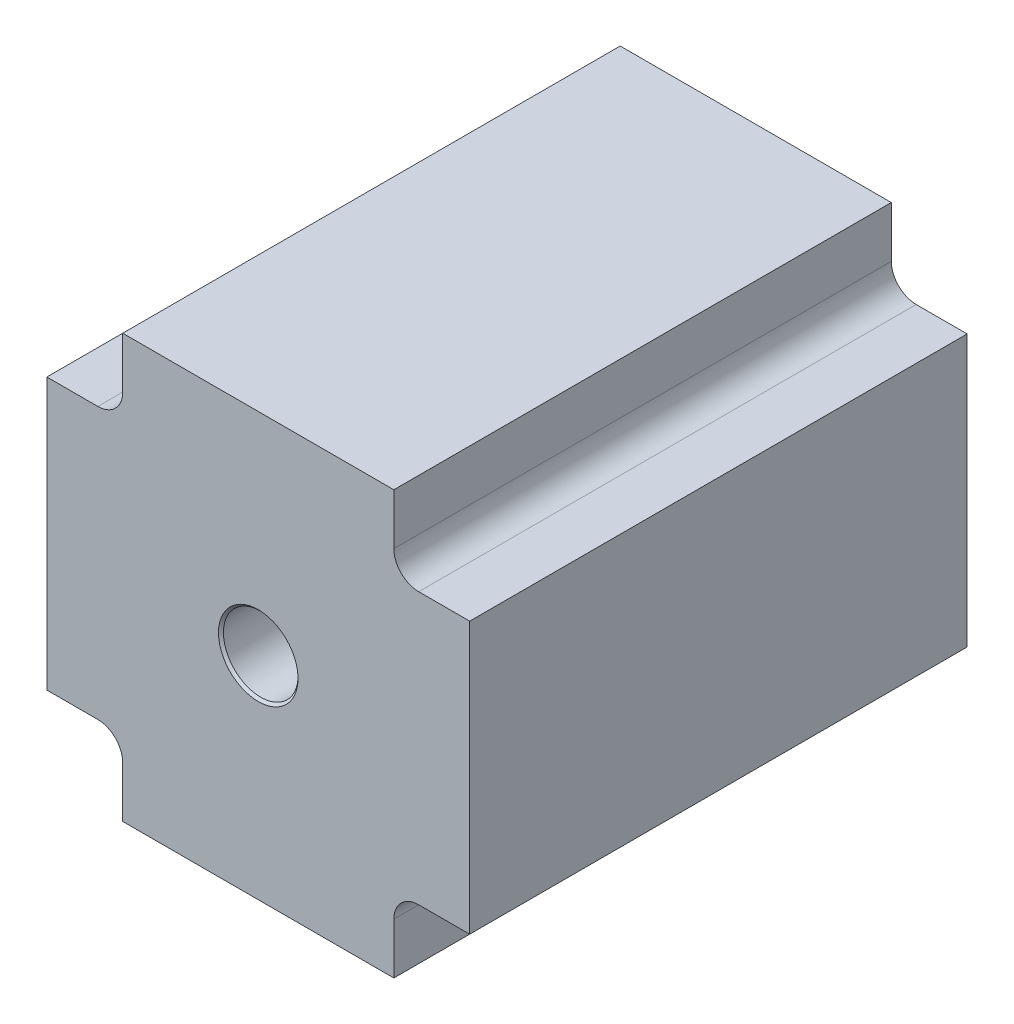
from build123d import *

# Parameters (mm, degrees)
EXTRUDE_1_DEPTH     = 100
SKETCH_3_R          = 7.5
CUT_EXTRUDE_2_DEPTH = 117.672618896
CHAMFER_3_SIZE      = 0.5
FILLET_1_R          = 5


with BuildPart() as part:
    # Sketch 1 → Extrude 1 (new body)
    with BuildSketch(Plane.XY):
        Polygon((27.25, 42.5), (-27.25, 42.5), (-27.25, 27.25), (-42.5, 27.25), (-42.5, -27.25), (-27.25, -27.25), (-27.25, -42.5), (27.25, -42.5), (27.25, -27.25), (42.5, -27.25), (42.5, 27.25), (27.25, 27.25), align=None)
    extrude(amount=EXTRUDE_1_DEPTH)

    # Sketch 3 → Cut-Extrude 2 (cut, through all)
    with BuildSketch(Plane.XY.offset(100)):
        Circle(SKETCH_3_R)
    extrude(amount=-CUT_EXTRUDE_2_DEPTH, mode=Mode.SUBTRACT)

    # Chamfer 3
    chamfer_3_edges = [part.edges().sort_by_distance(p)[0] for p in [
        (-7.5, 0, 0),
        (-7.5, 0, 100),
    ]]
    chamfer(chamfer_3_edges, length=CHAMFER_3_SIZE)

    # Fillet 1
    fillet_1_edges = [part.edges().sort_by_distance(p)[0] for p in [
        (-27.25, -27.25, 50),
        (-27.25, 27.25, 50),
        (27.25, 27.25, 50),
        (27.25, -27.25, 50),
    ]]
    fillet(fillet_1_edges, radius=FILLET_1_R)


solid = part.part
